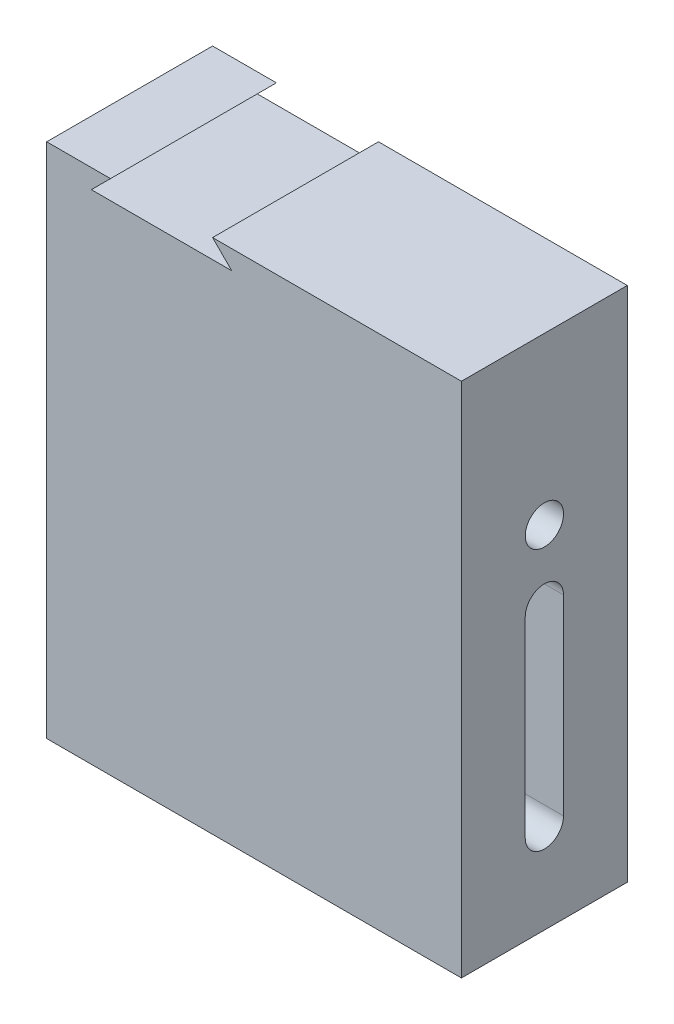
ISO-10303-21;
HEADER;
FILE_DESCRIPTION(('STEP AP214'),'2;1');
FILE_NAME('part.step','',(''),(''),'','','');
FILE_SCHEMA(('AUTOMOTIVE_DESIGN { 1 0 10303 214 1 1 1 1 }'));
ENDSEC;
DATA;
#1=APPLICATION_CONTEXT('core data for automotive mechanical design processes');
#2=APPLICATION_PROTOCOL_DEFINITION('international standard','automotive_design',2000,#1);
#3=PRODUCT_CONTEXT('',#1,'mechanical');
#4=PRODUCT('Part','Part','',(#3));
#5=PRODUCT_RELATED_PRODUCT_CATEGORY('part','',(#4));
#6=PRODUCT_DEFINITION_FORMATION('','',#4);
#7=PRODUCT_DEFINITION_CONTEXT('part definition',#1,'design');
#8=PRODUCT_DEFINITION('design','',#6,#7);
#9=PRODUCT_DEFINITION_SHAPE('','',#8);
#10=(LENGTH_UNIT() NAMED_UNIT(*) SI_UNIT(.MILLI.,.METRE.));
#11=(NAMED_UNIT(*) PLANE_ANGLE_UNIT() SI_UNIT($,.RADIAN.));
#12=(NAMED_UNIT(*) SI_UNIT($,.STERADIAN.) SOLID_ANGLE_UNIT());
#13=UNCERTAINTY_MEASURE_WITH_UNIT(LENGTH_MEASURE(1.E-05),#10,'distance_accuracy_value','');
#14=(GEOMETRIC_REPRESENTATION_CONTEXT(3) GLOBAL_UNCERTAINTY_ASSIGNED_CONTEXT((#13)) GLOBAL_UNIT_ASSIGNED_CONTEXT((#10,
#11,#12)) REPRESENTATION_CONTEXT('',''));
#15=CARTESIAN_POINT('',(0.,0.,0.));
#16=DIRECTION('',(0.,0.,1.));
#17=DIRECTION('',(1.,0.,0.));
#18=AXIS2_PLACEMENT_3D('',#15,#16,#17);
#19=CARTESIAN_POINT('',(0.,81.,26.));
#20=DIRECTION('',(0.,-1.,0.));
#21=DIRECTION('',(0.,0.,-1.));
#22=AXIS2_PLACEMENT_3D('',#19,#20,#21);
#23=PLANE('',#22);
#24=DIRECTION('',(-1.,0.,0.));
#25=VECTOR('',#24,1.);
#26=CARTESIAN_POINT('',(0.,81.,26.));
#27=LINE('',#26,#25);
#28=CARTESIAN_POINT('',(10.,81.,26.));
#29=VERTEX_POINT('',#28);
#30=CARTESIAN_POINT('',(0.,81.,26.));
#31=VERTEX_POINT('',#30);
#32=EDGE_CURVE('E202',#29,#31,#27,.T.);
#33=ORIENTED_EDGE('',*,*,#32,.F.);
#34=DIRECTION('',(0.,0.,1.));
#35=VECTOR('',#34,1.);
#36=CARTESIAN_POINT('',(10.,81.,0.));
#37=LINE('',#36,#35);
#38=CARTESIAN_POINT('',(10.,81.,0.));
#39=VERTEX_POINT('',#38);
#40=EDGE_CURVE('E129',#39,#29,#37,.T.);
#41=ORIENTED_EDGE('',*,*,#40,.F.);
#42=DIRECTION('',(-1.,0.,0.));
#43=VECTOR('',#42,1.);
#44=CARTESIAN_POINT('',(0.,81.,0.));
#45=LINE('',#44,#43);
#46=CARTESIAN_POINT('',(0.,81.,0.));
#47=VERTEX_POINT('',#46);
#48=EDGE_CURVE('E191',#39,#47,#45,.T.);
#49=ORIENTED_EDGE('',*,*,#48,.T.);
#50=DIRECTION('',(0.,0.,-1.));
#51=VECTOR('',#50,1.);
#52=CARTESIAN_POINT('',(0.,81.,26.));
#53=LINE('',#52,#51);
#54=EDGE_CURVE('E205',#31,#47,#53,.T.);
#55=ORIENTED_EDGE('',*,*,#54,.F.);
#56=EDGE_LOOP('',(#33,#41,#49,#55));
#57=FACE_BOUND('',#56,.T.);
#58=ADVANCED_FACE('F24',(#57),#23,.F.);
#59=CARTESIAN_POINT('',(0.,0.,26.));
#60=DIRECTION('',(1.,0.,0.));
#61=DIRECTION('',(0.,0.,-1.));
#62=AXIS2_PLACEMENT_3D('',#59,#60,#61);
#63=PLANE('',#62);
#64=DIRECTION('',(0.,-1.,0.));
#65=VECTOR('',#64,1.);
#66=CARTESIAN_POINT('',(0.,0.,0.));
#67=LINE('',#66,#65);
#68=CARTESIAN_POINT('',(0.,0.,0.));
#69=VERTEX_POINT('',#68);
#70=EDGE_CURVE('E184',#47,#69,#67,.T.);
#71=ORIENTED_EDGE('',*,*,#70,.T.);
#72=DIRECTION('',(0.,0.,-1.));
#73=VECTOR('',#72,1.);
#74=CARTESIAN_POINT('',(0.,0.,26.));
#75=LINE('',#74,#73);
#76=CARTESIAN_POINT('',(0.,0.,26.));
#77=VERTEX_POINT('',#76);
#78=EDGE_CURVE('E11',#77,#69,#75,.T.);
#79=ORIENTED_EDGE('',*,*,#78,.F.);
#80=DIRECTION('',(0.,-1.,0.));
#81=VECTOR('',#80,1.);
#82=CARTESIAN_POINT('',(0.,0.,26.));
#83=LINE('',#82,#81);
#84=EDGE_CURVE('E195',#31,#77,#83,.T.);
#85=ORIENTED_EDGE('',*,*,#84,.F.);
#86=ORIENTED_EDGE('',*,*,#54,.T.);
#87=EDGE_LOOP('',(#71,#79,#85,#86));
#88=FACE_BOUND('',#87,.T.);
#89=ADVANCED_FACE('F26',(#88),#63,.F.);
#90=CARTESIAN_POINT('',(0.,0.,26.));
#91=DIRECTION('',(0.,1.,0.));
#92=DIRECTION('',(0.,0.,1.));
#93=AXIS2_PLACEMENT_3D('',#90,#91,#92);
#94=PLANE('',#93);
#95=DIRECTION('',(1.,0.,0.));
#96=VECTOR('',#95,1.);
#97=CARTESIAN_POINT('',(0.,0.,0.));
#98=LINE('',#97,#96);
#99=CARTESIAN_POINT('',(65.,0.,0.));
#100=VERTEX_POINT('',#99);
#101=EDGE_CURVE('E187',#69,#100,#98,.T.);
#102=ORIENTED_EDGE('',*,*,#101,.T.);
#103=DIRECTION('',(0.,0.,-1.));
#104=VECTOR('',#103,1.);
#105=CARTESIAN_POINT('',(65.,0.,26.));
#106=LINE('',#105,#104);
#107=CARTESIAN_POINT('',(65.,0.,26.));
#108=VERTEX_POINT('',#107);
#109=EDGE_CURVE('E32',#108,#100,#106,.T.);
#110=ORIENTED_EDGE('',*,*,#109,.F.);
#111=DIRECTION('',(1.,0.,0.));
#112=VECTOR('',#111,1.);
#113=CARTESIAN_POINT('',(0.,0.,26.));
#114=LINE('',#113,#112);
#115=EDGE_CURVE('E198',#77,#108,#114,.T.);
#116=ORIENTED_EDGE('',*,*,#115,.F.);
#117=ORIENTED_EDGE('',*,*,#78,.T.);
#118=EDGE_LOOP('',(#102,#110,#116,#117));
#119=FACE_BOUND('',#118,.T.);
#120=ADVANCED_FACE('F227',(#119),#94,.F.);
#121=CARTESIAN_POINT('',(65.,0.,26.));
#122=DIRECTION('',(-1.,0.,0.));
#123=DIRECTION('',(0.,0.,1.));
#124=AXIS2_PLACEMENT_3D('',#121,#122,#123);
#125=PLANE('',#124);
#126=DIRECTION('',(0.,-1.,0.));
#127=VECTOR('',#126,1.);
#128=CARTESIAN_POINT('',(65.,44.,16.));
#129=LINE('',#128,#127);
#130=CARTESIAN_POINT('',(65.,44.,16.));
#131=VERTEX_POINT('',#130);
#132=CARTESIAN_POINT('',(65.,14.,16.));
#133=VERTEX_POINT('',#132);
#134=EDGE_CURVE('E149',#131,#133,#129,.T.);
#135=ORIENTED_EDGE('',*,*,#134,.F.);
#136=CARTESIAN_POINT('',(65.,44.,13.));
#137=DIRECTION('',(1.,0.,0.));
#138=DIRECTION('',(0.,0.,1.));
#139=AXIS2_PLACEMENT_3D('',#136,#137,#138);
#140=CIRCLE('',#139,3.00000000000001);
#141=CARTESIAN_POINT('',(65.,44.,10.));
#142=VERTEX_POINT('',#141);
#143=EDGE_CURVE('E47',#142,#131,#140,.T.);
#144=ORIENTED_EDGE('',*,*,#143,.F.);
#145=DIRECTION('',(0.,1.,0.));
#146=VECTOR('',#145,1.);
#147=CARTESIAN_POINT('',(65.,44.,10.));
#148=LINE('',#147,#146);
#149=CARTESIAN_POINT('',(65.,14.,9.99999999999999));
#150=VERTEX_POINT('',#149);
#151=EDGE_CURVE('E155',#150,#142,#148,.T.);
#152=ORIENTED_EDGE('',*,*,#151,.F.);
#153=CARTESIAN_POINT('',(65.,14.,13.));
#154=DIRECTION('',(1.,0.,0.));
#155=DIRECTION('',(0.,0.,-1.));
#156=AXIS2_PLACEMENT_3D('',#153,#154,#155);
#157=CIRCLE('',#156,3.00000000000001);
#158=EDGE_CURVE('E152',#133,#150,#157,.T.);
#159=ORIENTED_EDGE('',*,*,#158,.F.);
#160=EDGE_LOOP('',(#135,#144,#152,#159));
#161=FACE_BOUND('',#160,.T.);
#162=CARTESIAN_POINT('',(65.,55.,13.));
#163=DIRECTION('',(1.,0.,0.));
#164=DIRECTION('',(0.,0.,-1.));
#165=AXIS2_PLACEMENT_3D('',#162,#163,#164);
#166=CIRCLE('',#165,3.);
#167=CARTESIAN_POINT('',(65.,55.,9.99999999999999));
#168=VERTEX_POINT('',#167);
#169=EDGE_CURVE('E173',#168,#168,#166,.T.);
#170=ORIENTED_EDGE('',*,*,#169,.F.);
#171=EDGE_LOOP('',(#170));
#172=FACE_BOUND('',#171,.T.);
#173=DIRECTION('',(0.,1.,0.));
#174=VECTOR('',#173,1.);
#175=CARTESIAN_POINT('',(65.,0.,0.));
#176=LINE('',#175,#174);
#177=CARTESIAN_POINT('',(65.,81.,0.));
#178=VERTEX_POINT('',#177);
#179=EDGE_CURVE('E189',#100,#178,#176,.T.);
#180=ORIENTED_EDGE('',*,*,#179,.T.);
#181=DIRECTION('',(0.,0.,-1.));
#182=VECTOR('',#181,1.);
#183=CARTESIAN_POINT('',(65.,81.,26.));
#184=LINE('',#183,#182);
#185=CARTESIAN_POINT('',(65.,81.,26.));
#186=VERTEX_POINT('',#185);
#187=EDGE_CURVE('E208',#186,#178,#184,.T.);
#188=ORIENTED_EDGE('',*,*,#187,.F.);
#189=DIRECTION('',(0.,1.,0.));
#190=VECTOR('',#189,1.);
#191=CARTESIAN_POINT('',(65.,0.,26.));
#192=LINE('',#191,#190);
#193=EDGE_CURVE('E200',#108,#186,#192,.T.);
#194=ORIENTED_EDGE('',*,*,#193,.F.);
#195=ORIENTED_EDGE('',*,*,#109,.T.);
#196=EDGE_LOOP('',(#180,#188,#194,#195));
#197=FACE_BOUND('',#196,.T.);
#198=ADVANCED_FACE('F215',(#161,#172,#197),#125,.F.);
#199=CARTESIAN_POINT('',(26.,81.,0.));
#200=VERTEX_POINT('',#199);
#201=EDGE_CURVE('E192',#178,#200,#45,.T.);
#202=ORIENTED_EDGE('',*,*,#201,.T.);
#203=DIRECTION('',(0.,0.,1.));
#204=VECTOR('',#203,1.);
#205=CARTESIAN_POINT('',(26.,81.,0.));
#206=LINE('',#205,#204);
#207=CARTESIAN_POINT('',(26.,81.,26.));
#208=VERTEX_POINT('',#207);
#209=EDGE_CURVE('E144',#200,#208,#206,.T.);
#210=ORIENTED_EDGE('',*,*,#209,.T.);
#211=EDGE_CURVE('E203',#186,#208,#27,.T.);
#212=ORIENTED_EDGE('',*,*,#211,.F.);
#213=ORIENTED_EDGE('',*,*,#187,.T.);
#214=EDGE_LOOP('',(#202,#210,#212,#213));
#215=FACE_BOUND('',#214,.T.);
#216=ADVANCED_FACE('F223',(#215),#23,.F.);
#217=CARTESIAN_POINT('',(0.,81.,26.));
#218=DIRECTION('',(0.,0.,-1.));
#219=DIRECTION('',(-1.,0.,0.));
#220=AXIS2_PLACEMENT_3D('',#217,#218,#219);
#221=PLANE('',#220);
#222=DIRECTION('',(1.,0.,0.));
#223=VECTOR('',#222,1.);
#224=CARTESIAN_POINT('',(29.,78.,26.));
#225=LINE('',#224,#223);
#226=CARTESIAN_POINT('',(6.99999999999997,78.,26.));
#227=VERTEX_POINT('',#226);
#228=CARTESIAN_POINT('',(29.,78.,26.));
#229=VERTEX_POINT('',#228);
#230=EDGE_CURVE('E117',#227,#229,#225,.T.);
#231=ORIENTED_EDGE('',*,*,#230,.F.);
#232=DIRECTION('',(-0.70710678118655,-0.707106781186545,0.));
#233=VECTOR('',#232,1.);
#234=CARTESIAN_POINT('',(6.99999999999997,78.,26.));
#235=LINE('',#234,#233);
#236=EDGE_CURVE('E126',#29,#227,#235,.T.);
#237=ORIENTED_EDGE('',*,*,#236,.F.);
#238=ORIENTED_EDGE('',*,*,#32,.T.);
#239=ORIENTED_EDGE('',*,*,#84,.T.);
#240=ORIENTED_EDGE('',*,*,#115,.T.);
#241=ORIENTED_EDGE('',*,*,#193,.T.);
#242=ORIENTED_EDGE('',*,*,#211,.T.);
#243=DIRECTION('',(-0.707106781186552,0.707106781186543,0.));
#244=VECTOR('',#243,1.);
#245=CARTESIAN_POINT('',(26.,81.,26.));
#246=LINE('',#245,#244);
#247=EDGE_CURVE('E135',#229,#208,#246,.T.);
#248=ORIENTED_EDGE('',*,*,#247,.F.);
#249=EDGE_LOOP('',(#231,#237,#238,#239,#240,#241,#242,#248));
#250=FACE_BOUND('',#249,.T.);
#251=ADVANCED_FACE('F133',(#250),#221,.F.);
#252=CARTESIAN_POINT('',(0.,81.,0.));
#253=DIRECTION('',(0.,0.,-1.));
#254=DIRECTION('',(-1.,0.,0.));
#255=AXIS2_PLACEMENT_3D('',#252,#253,#254);
#256=PLANE('',#255);
#257=DIRECTION('',(-0.70710678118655,-0.707106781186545,0.));
#258=VECTOR('',#257,1.);
#259=CARTESIAN_POINT('',(6.99999999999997,78.,0.));
#260=LINE('',#259,#258);
#261=CARTESIAN_POINT('',(6.99999999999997,78.,0.));
#262=VERTEX_POINT('',#261);
#263=EDGE_CURVE('E137',#39,#262,#260,.T.);
#264=ORIENTED_EDGE('',*,*,#263,.T.);
#265=DIRECTION('',(1.,0.,0.));
#266=VECTOR('',#265,1.);
#267=CARTESIAN_POINT('',(29.,78.,0.));
#268=LINE('',#267,#266);
#269=CARTESIAN_POINT('',(29.,78.,0.));
#270=VERTEX_POINT('',#269);
#271=EDGE_CURVE('E120',#262,#270,#268,.T.);
#272=ORIENTED_EDGE('',*,*,#271,.T.);
#273=DIRECTION('',(-0.707106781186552,0.707106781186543,0.));
#274=VECTOR('',#273,1.);
#275=CARTESIAN_POINT('',(26.,81.,0.));
#276=LINE('',#275,#274);
#277=EDGE_CURVE('E39',#270,#200,#276,.T.);
#278=ORIENTED_EDGE('',*,*,#277,.T.);
#279=ORIENTED_EDGE('',*,*,#201,.F.);
#280=ORIENTED_EDGE('',*,*,#179,.F.);
#281=ORIENTED_EDGE('',*,*,#101,.F.);
#282=ORIENTED_EDGE('',*,*,#70,.F.);
#283=ORIENTED_EDGE('',*,*,#48,.F.);
#284=EDGE_LOOP('',(#264,#272,#278,#279,#280,#281,#282,#283));
#285=FACE_BOUND('',#284,.T.);
#286=ADVANCED_FACE('F220',(#285),#256,.T.);
#287=CARTESIAN_POINT('',(50.,55.,13.));
#288=DIRECTION('',(1.,0.,0.));
#289=DIRECTION('',(0.,0.,-1.));
#290=AXIS2_PLACEMENT_3D('',#287,#288,#289);
#291=CYLINDRICAL_SURFACE('',#290,3.);
#292=CARTESIAN_POINT('',(50.,55.,13.));
#293=DIRECTION('',(1.,0.,0.));
#294=DIRECTION('',(0.,0.,-1.));
#295=AXIS2_PLACEMENT_3D('',#292,#293,#294);
#296=CIRCLE('',#295,3.);
#297=CARTESIAN_POINT('',(50.,55.,9.99999999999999));
#298=VERTEX_POINT('',#297);
#299=EDGE_CURVE('E181',#298,#298,#296,.T.);
#300=ORIENTED_EDGE('',*,*,#299,.F.);
#301=EDGE_LOOP('',(#300));
#302=FACE_BOUND('',#301,.T.);
#303=ORIENTED_EDGE('',*,*,#169,.T.);
#304=EDGE_LOOP('',(#303));
#305=FACE_BOUND('',#304,.T.);
#306=ADVANCED_FACE('F253',(#302,#305),#291,.F.);
#307=CARTESIAN_POINT('',(50.,55.,13.));
#308=DIRECTION('',(1.,0.,0.));
#309=DIRECTION('',(0.,0.,-1.));
#310=AXIS2_PLACEMENT_3D('',#307,#308,#309);
#311=PLANE('',#310);
#312=ORIENTED_EDGE('',*,*,#299,.T.);
#313=EDGE_LOOP('',(#312));
#314=FACE_BOUND('',#313,.T.);
#315=ADVANCED_FACE('F255',(#314),#311,.T.);
#316=CARTESIAN_POINT('',(51.,44.,13.));
#317=DIRECTION('',(1.,0.,0.));
#318=DIRECTION('',(0.,0.,-1.));
#319=AXIS2_PLACEMENT_3D('',#316,#317,#318);
#320=CYLINDRICAL_SURFACE('',#319,3.00000000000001);
#321=ORIENTED_EDGE('',*,*,#143,.T.);
#322=DIRECTION('',(1.,0.,0.));
#323=VECTOR('',#322,1.);
#324=CARTESIAN_POINT('',(51.,44.,16.));
#325=LINE('',#324,#323);
#326=CARTESIAN_POINT('',(51.,44.,16.));
#327=VERTEX_POINT('',#326);
#328=EDGE_CURVE('E170',#327,#131,#325,.T.);
#329=ORIENTED_EDGE('',*,*,#328,.F.);
#330=CARTESIAN_POINT('',(51.,44.,13.));
#331=DIRECTION('',(1.,0.,0.));
#332=DIRECTION('',(0.,0.,1.));
#333=AXIS2_PLACEMENT_3D('',#330,#331,#332);
#334=CIRCLE('',#333,3.00000000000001);
#335=CARTESIAN_POINT('',(51.,44.,10.));
#336=VERTEX_POINT('',#335);
#337=EDGE_CURVE('E158',#336,#327,#334,.T.);
#338=ORIENTED_EDGE('',*,*,#337,.F.);
#339=DIRECTION('',(1.,0.,0.));
#340=VECTOR('',#339,1.);
#341=CARTESIAN_POINT('',(51.,44.,10.));
#342=LINE('',#341,#340);
#343=EDGE_CURVE('E171',#336,#142,#342,.T.);
#344=ORIENTED_EDGE('',*,*,#343,.T.);
#345=EDGE_LOOP('',(#321,#329,#338,#344));
#346=FACE_BOUND('',#345,.T.);
#347=ADVANCED_FACE('F262',(#346),#320,.F.);
#348=CARTESIAN_POINT('',(51.,44.,10.));
#349=DIRECTION('',(0.,0.,-1.));
#350=DIRECTION('',(0.,1.,0.));
#351=AXIS2_PLACEMENT_3D('',#348,#349,#350);
#352=PLANE('',#351);
#353=ORIENTED_EDGE('',*,*,#151,.T.);
#354=ORIENTED_EDGE('',*,*,#343,.F.);
#355=DIRECTION('',(0.,1.,0.));
#356=VECTOR('',#355,1.);
#357=CARTESIAN_POINT('',(51.,44.,10.));
#358=LINE('',#357,#356);
#359=CARTESIAN_POINT('',(51.,14.,9.99999999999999));
#360=VERTEX_POINT('',#359);
#361=EDGE_CURVE('E167',#360,#336,#358,.T.);
#362=ORIENTED_EDGE('',*,*,#361,.F.);
#363=DIRECTION('',(1.,0.,0.));
#364=VECTOR('',#363,1.);
#365=CARTESIAN_POINT('',(51.,14.,9.99999999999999));
#366=LINE('',#365,#364);
#367=EDGE_CURVE('E174',#360,#150,#366,.T.);
#368=ORIENTED_EDGE('',*,*,#367,.T.);
#369=EDGE_LOOP('',(#353,#354,#362,#368));
#370=FACE_BOUND('',#369,.T.);
#371=ADVANCED_FACE('F270',(#370),#352,.F.);
#372=CARTESIAN_POINT('',(51.,14.,13.));
#373=DIRECTION('',(1.,0.,0.));
#374=DIRECTION('',(0.,0.,-1.));
#375=AXIS2_PLACEMENT_3D('',#372,#373,#374);
#376=CYLINDRICAL_SURFACE('',#375,3.00000000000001);
#377=ORIENTED_EDGE('',*,*,#158,.T.);
#378=ORIENTED_EDGE('',*,*,#367,.F.);
#379=CARTESIAN_POINT('',(51.,14.,13.));
#380=DIRECTION('',(1.,0.,0.));
#381=DIRECTION('',(0.,0.,-1.));
#382=AXIS2_PLACEMENT_3D('',#379,#380,#381);
#383=CIRCLE('',#382,3.00000000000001);
#384=CARTESIAN_POINT('',(51.,14.,16.));
#385=VERTEX_POINT('',#384);
#386=EDGE_CURVE('E164',#385,#360,#383,.T.);
#387=ORIENTED_EDGE('',*,*,#386,.F.);
#388=DIRECTION('',(1.,0.,0.));
#389=VECTOR('',#388,1.);
#390=CARTESIAN_POINT('',(51.,14.,16.));
#391=LINE('',#390,#389);
#392=EDGE_CURVE('E176',#385,#133,#391,.T.);
#393=ORIENTED_EDGE('',*,*,#392,.T.);
#394=EDGE_LOOP('',(#377,#378,#387,#393));
#395=FACE_BOUND('',#394,.T.);
#396=ADVANCED_FACE('F275',(#395),#376,.F.);
#397=CARTESIAN_POINT('',(51.,44.,16.));
#398=DIRECTION('',(0.,0.,1.));
#399=DIRECTION('',(0.,-1.,0.));
#400=AXIS2_PLACEMENT_3D('',#397,#398,#399);
#401=PLANE('',#400);
#402=ORIENTED_EDGE('',*,*,#134,.T.);
#403=ORIENTED_EDGE('',*,*,#392,.F.);
#404=DIRECTION('',(0.,-1.,0.));
#405=VECTOR('',#404,1.);
#406=CARTESIAN_POINT('',(51.,44.,16.));
#407=LINE('',#406,#405);
#408=EDGE_CURVE('E161',#327,#385,#407,.T.);
#409=ORIENTED_EDGE('',*,*,#408,.F.);
#410=ORIENTED_EDGE('',*,*,#328,.T.);
#411=EDGE_LOOP('',(#402,#403,#409,#410));
#412=FACE_BOUND('',#411,.T.);
#413=ADVANCED_FACE('F271',(#412),#401,.F.);
#414=CARTESIAN_POINT('',(51.,44.,13.));
#415=DIRECTION('',(-1.,0.,0.));
#416=DIRECTION('',(0.,0.,1.));
#417=AXIS2_PLACEMENT_3D('',#414,#415,#416);
#418=PLANE('',#417);
#419=ORIENTED_EDGE('',*,*,#337,.T.);
#420=ORIENTED_EDGE('',*,*,#408,.T.);
#421=ORIENTED_EDGE('',*,*,#386,.T.);
#422=ORIENTED_EDGE('',*,*,#361,.T.);
#423=EDGE_LOOP('',(#419,#420,#421,#422));
#424=FACE_BOUND('',#423,.T.);
#425=ADVANCED_FACE('F274',(#424),#418,.F.);
#426=CARTESIAN_POINT('',(6.99999999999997,78.,0.));
#427=DIRECTION('',(-0.707106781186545,0.70710678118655,0.));
#428=DIRECTION('',(-0.70710678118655,-0.707106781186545,0.));
#429=AXIS2_PLACEMENT_3D('',#426,#427,#428);
#430=PLANE('',#429);
#431=ORIENTED_EDGE('',*,*,#236,.T.);
#432=DIRECTION('',(0.,0.,1.));
#433=VECTOR('',#432,1.);
#434=CARTESIAN_POINT('',(6.99999999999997,78.,0.));
#435=LINE('',#434,#433);
#436=EDGE_CURVE('E113',#262,#227,#435,.T.);
#437=ORIENTED_EDGE('',*,*,#436,.F.);
#438=ORIENTED_EDGE('',*,*,#263,.F.);
#439=ORIENTED_EDGE('',*,*,#40,.T.);
#440=EDGE_LOOP('',(#431,#437,#438,#439));
#441=FACE_BOUND('',#440,.T.);
#442=ADVANCED_FACE('F127',(#441),#430,.F.);
#443=CARTESIAN_POINT('',(26.,81.,0.));
#444=DIRECTION('',(0.707106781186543,0.707106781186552,0.));
#445=DIRECTION('',(-0.707106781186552,0.707106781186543,0.));
#446=AXIS2_PLACEMENT_3D('',#443,#444,#445);
#447=PLANE('',#446);
#448=ORIENTED_EDGE('',*,*,#247,.T.);
#449=ORIENTED_EDGE('',*,*,#209,.F.);
#450=ORIENTED_EDGE('',*,*,#277,.F.);
#451=DIRECTION('',(0.,0.,1.));
#452=VECTOR('',#451,1.);
#453=CARTESIAN_POINT('',(29.,78.,0.));
#454=LINE('',#453,#452);
#455=EDGE_CURVE('E123',#270,#229,#454,.T.);
#456=ORIENTED_EDGE('',*,*,#455,.T.);
#457=EDGE_LOOP('',(#448,#449,#450,#456));
#458=FACE_BOUND('',#457,.T.);
#459=ADVANCED_FACE('F288',(#458),#447,.F.);
#460=CARTESIAN_POINT('',(29.,78.,0.));
#461=DIRECTION('',(0.,-1.,0.));
#462=DIRECTION('',(0.,0.,-1.));
#463=AXIS2_PLACEMENT_3D('',#460,#461,#462);
#464=PLANE('',#463);
#465=ORIENTED_EDGE('',*,*,#230,.T.);
#466=ORIENTED_EDGE('',*,*,#455,.F.);
#467=ORIENTED_EDGE('',*,*,#271,.F.);
#468=ORIENTED_EDGE('',*,*,#436,.T.);
#469=EDGE_LOOP('',(#465,#466,#467,#468));
#470=FACE_BOUND('',#469,.T.);
#471=ADVANCED_FACE('F115',(#470),#464,.F.);
#472=CLOSED_SHELL('',(#58,#89,#120,#198,#216,#251,#286,#306,#315,#347,#371,#396,#413,#425,#442,
#459,#471));
#473=MANIFOLD_SOLID_BREP('B2',#472);
#474=ADVANCED_BREP_SHAPE_REPRESENTATION('',(#18,#473),#14);
#475=SHAPE_DEFINITION_REPRESENTATION(#9,#474);
ENDSEC;
END-ISO-10303-21;
